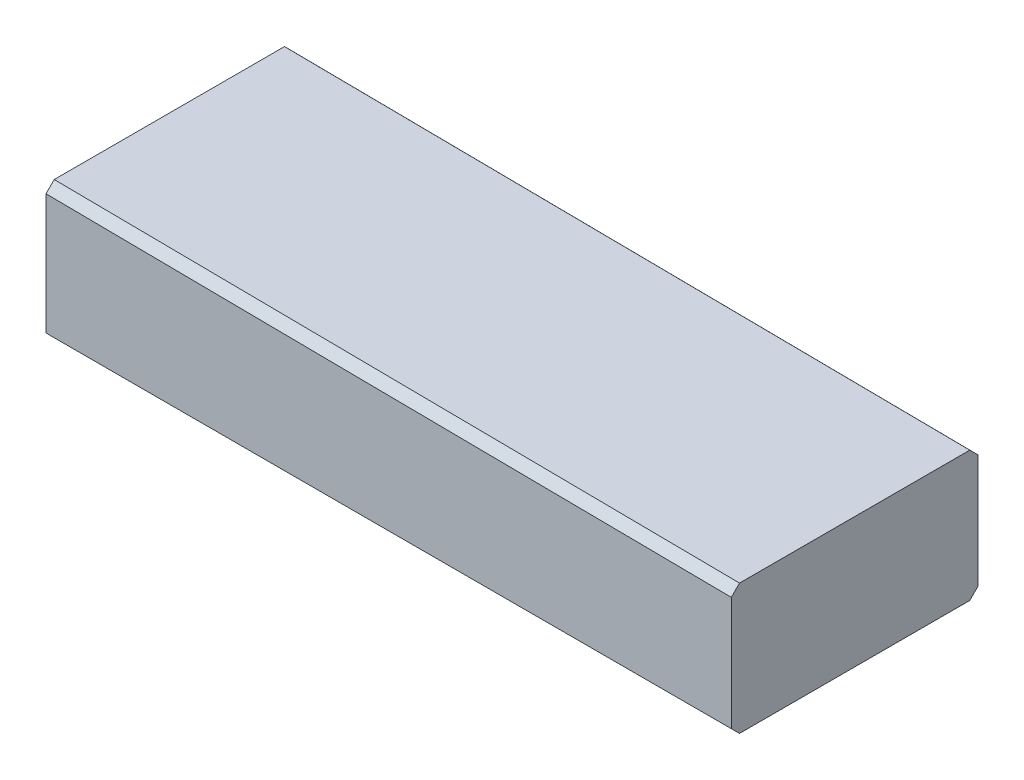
ISO-10303-21;
HEADER;
FILE_DESCRIPTION(('STEP AP214'),'2;1');
FILE_NAME('part.step','',(''),(''),'','','');
FILE_SCHEMA(('AUTOMOTIVE_DESIGN { 1 0 10303 214 1 1 1 1 }'));
ENDSEC;
DATA;
#1=APPLICATION_CONTEXT('core data for automotive mechanical design processes');
#2=APPLICATION_PROTOCOL_DEFINITION('international standard','automotive_design',2000,#1);
#3=PRODUCT_CONTEXT('',#1,'mechanical');
#4=PRODUCT('Part','Part','',(#3));
#5=PRODUCT_RELATED_PRODUCT_CATEGORY('part','',(#4));
#6=PRODUCT_DEFINITION_FORMATION('','',#4);
#7=PRODUCT_DEFINITION_CONTEXT('part definition',#1,'design');
#8=PRODUCT_DEFINITION('design','',#6,#7);
#9=PRODUCT_DEFINITION_SHAPE('','',#8);
#10=(LENGTH_UNIT() NAMED_UNIT(*) SI_UNIT(.MILLI.,.METRE.));
#11=(NAMED_UNIT(*) PLANE_ANGLE_UNIT() SI_UNIT($,.RADIAN.));
#12=(NAMED_UNIT(*) SI_UNIT($,.STERADIAN.) SOLID_ANGLE_UNIT());
#13=UNCERTAINTY_MEASURE_WITH_UNIT(LENGTH_MEASURE(1.E-05),#10,'distance_accuracy_value','');
#14=(GEOMETRIC_REPRESENTATION_CONTEXT(3) GLOBAL_UNCERTAINTY_ASSIGNED_CONTEXT((#13)) GLOBAL_UNIT_ASSIGNED_CONTEXT((#10,
#11,#12)) REPRESENTATION_CONTEXT('',''));
#15=CARTESIAN_POINT('',(0.,0.,0.));
#16=DIRECTION('',(0.,0.,1.));
#17=DIRECTION('',(1.,0.,0.));
#18=AXIS2_PLACEMENT_3D('',#15,#16,#17);
#19=CARTESIAN_POINT('',(100.,0.,36.));
#20=DIRECTION('',(0.,1.,0.));
#21=DIRECTION('',(0.,0.,1.));
#22=AXIS2_PLACEMENT_3D('',#19,#20,#21);
#23=PLANE('',#22);
#24=DIRECTION('',(0.,0.,-1.));
#25=VECTOR('',#24,1.);
#26=CARTESIAN_POINT('',(0.,0.,36.));
#27=LINE('',#26,#25);
#28=CARTESIAN_POINT('',(0.,0.,34.8));
#29=VERTEX_POINT('',#28);
#30=CARTESIAN_POINT('',(0.,0.,1.20000000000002));
#31=VERTEX_POINT('',#30);
#32=EDGE_CURVE('E121',#29,#31,#27,.T.);
#33=ORIENTED_EDGE('',*,*,#32,.T.);
#34=DIRECTION('',(1.,0.,0.));
#35=VECTOR('',#34,1.);
#36=CARTESIAN_POINT('',(100.,0.,1.20000000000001));
#37=LINE('',#36,#35);
#38=CARTESIAN_POINT('',(100.,0.,1.20000000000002));
#39=VERTEX_POINT('',#38);
#40=EDGE_CURVE('E147',#31,#39,#37,.T.);
#41=ORIENTED_EDGE('',*,*,#40,.T.);
#42=DIRECTION('',(0.,0.,-1.));
#43=VECTOR('',#42,1.);
#44=CARTESIAN_POINT('',(100.,0.,36.));
#45=LINE('',#44,#43);
#46=CARTESIAN_POINT('',(100.,0.,34.8));
#47=VERTEX_POINT('',#46);
#48=EDGE_CURVE('E125',#47,#39,#45,.T.);
#49=ORIENTED_EDGE('',*,*,#48,.F.);
#50=DIRECTION('',(-1.,0.,0.));
#51=VECTOR('',#50,1.);
#52=CARTESIAN_POINT('',(100.,0.,34.8));
#53=LINE('',#52,#51);
#54=EDGE_CURVE('E145',#47,#29,#53,.T.);
#55=ORIENTED_EDGE('',*,*,#54,.T.);
#56=EDGE_LOOP('',(#33,#41,#49,#55));
#57=FACE_BOUND('',#56,.T.);
#58=ADVANCED_FACE('F33',(#57),#23,.F.);
#59=CARTESIAN_POINT('',(100.,19.,36.));
#60=DIRECTION('',(-1.,0.,0.));
#61=DIRECTION('',(0.,0.,1.));
#62=AXIS2_PLACEMENT_3D('',#59,#60,#61);
#63=PLANE('',#62);
#64=DIRECTION('',(0.,1.,0.));
#65=VECTOR('',#64,1.);
#66=CARTESIAN_POINT('',(100.,19.,0.));
#67=LINE('',#66,#65);
#68=CARTESIAN_POINT('',(100.,1.20000000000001,0.));
#69=VERTEX_POINT('',#68);
#70=CARTESIAN_POINT('',(100.,17.7999400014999,0.));
#71=VERTEX_POINT('',#70);
#72=EDGE_CURVE('E157',#69,#71,#67,.T.);
#73=ORIENTED_EDGE('',*,*,#72,.T.);
#74=DIRECTION('',(0.,0.707124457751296,0.707089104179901));
#75=VECTOR('',#74,1.);
#76=CARTESIAN_POINT('',(100.,19.5000249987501,1.69999999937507));
#77=LINE('',#76,#75);
#78=CARTESIAN_POINT('',(100.,19.,1.2));
#79=VERTEX_POINT('',#78);
#80=EDGE_CURVE('E143',#71,#79,#77,.T.);
#81=ORIENTED_EDGE('',*,*,#80,.T.);
#82=DIRECTION('',(0.,0.,-1.));
#83=VECTOR('',#82,1.);
#84=CARTESIAN_POINT('',(100.,19.,36.));
#85=LINE('',#84,#83);
#86=CARTESIAN_POINT('',(100.,19.,34.8));
#87=VERTEX_POINT('',#86);
#88=EDGE_CURVE('E120',#87,#79,#85,.T.);
#89=ORIENTED_EDGE('',*,*,#88,.F.);
#90=DIRECTION('',(0.,0.707124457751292,-0.707089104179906));
#91=VECTOR('',#90,1.);
#92=CARTESIAN_POINT('',(100.,18.2990250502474,35.5009399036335));
#93=LINE('',#92,#91);
#94=CARTESIAN_POINT('',(100.,17.7999400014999,36.));
#95=VERTEX_POINT('',#94);
#96=EDGE_CURVE('E124',#87,#95,#93,.F.);
#97=ORIENTED_EDGE('',*,*,#96,.T.);
#98=DIRECTION('',(0.,1.,0.));
#99=VECTOR('',#98,1.);
#100=CARTESIAN_POINT('',(100.,19.,36.));
#101=LINE('',#100,#99);
#102=CARTESIAN_POINT('',(100.,1.20000000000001,36.));
#103=VERTEX_POINT('',#102);
#104=EDGE_CURVE('E152',#103,#95,#101,.T.);
#105=ORIENTED_EDGE('',*,*,#104,.F.);
#106=DIRECTION('',(0.,0.707106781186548,0.707106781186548));
#107=VECTOR('',#106,1.);
#108=CARTESIAN_POINT('',(100.,1.20000000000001,36.));
#109=LINE('',#108,#107);
#110=EDGE_CURVE('E56',#103,#47,#109,.F.);
#111=ORIENTED_EDGE('',*,*,#110,.T.);
#112=ORIENTED_EDGE('',*,*,#48,.T.);
#113=DIRECTION('',(0.,0.707106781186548,-0.707106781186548));
#114=VECTOR('',#113,1.);
#115=CARTESIAN_POINT('',(100.,0.,1.20000000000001));
#116=LINE('',#115,#114);
#117=EDGE_CURVE('E48',#39,#69,#116,.T.);
#118=ORIENTED_EDGE('',*,*,#117,.T.);
#119=EDGE_LOOP('',(#73,#81,#89,#97,#105,#111,#112,#118));
#120=FACE_BOUND('',#119,.T.);
#121=ADVANCED_FACE('F186',(#120),#63,.F.);
#122=CARTESIAN_POINT('',(0.,20.,36.));
#123=DIRECTION('',(-0.00999950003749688,-0.999950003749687,0.));
#124=DIRECTION('',(0.999950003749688,-0.00999950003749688,0.));
#125=AXIS2_PLACEMENT_3D('',#122,#123,#124);
#126=PLANE('',#125);
#127=ORIENTED_EDGE('',*,*,#88,.T.);
#128=DIRECTION('',(-0.999950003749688,0.00999950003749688,0.));
#129=VECTOR('',#128,1.);
#130=CARTESIAN_POINT('',(0.,20.,1.20000000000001));
#131=LINE('',#130,#129);
#132=CARTESIAN_POINT('',(0.,20.,1.2));
#133=VERTEX_POINT('',#132);
#134=EDGE_CURVE('E111',#79,#133,#131,.T.);
#135=ORIENTED_EDGE('',*,*,#134,.T.);
#136=DIRECTION('',(0.,0.,-1.));
#137=VECTOR('',#136,1.);
#138=CARTESIAN_POINT('',(0.,20.,36.));
#139=LINE('',#138,#137);
#140=CARTESIAN_POINT('',(0.,20.,34.8));
#141=VERTEX_POINT('',#140);
#142=EDGE_CURVE('E103',#141,#133,#139,.T.);
#143=ORIENTED_EDGE('',*,*,#142,.F.);
#144=DIRECTION('',(0.999950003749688,-0.00999950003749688,0.));
#145=VECTOR('',#144,1.);
#146=CARTESIAN_POINT('',(0.,20.,34.8));
#147=LINE('',#146,#145);
#148=EDGE_CURVE('E117',#141,#87,#147,.T.);
#149=ORIENTED_EDGE('',*,*,#148,.T.);
#150=EDGE_LOOP('',(#127,#135,#143,#149));
#151=FACE_BOUND('',#150,.T.);
#152=ADVANCED_FACE('F116',(#151),#126,.F.);
#153=CARTESIAN_POINT('',(0.,0.,36.));
#154=DIRECTION('',(1.,0.,0.));
#155=DIRECTION('',(0.,0.,-1.));
#156=AXIS2_PLACEMENT_3D('',#153,#154,#155);
#157=PLANE('',#156);
#158=ORIENTED_EDGE('',*,*,#142,.T.);
#159=DIRECTION('',(0.,-0.707124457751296,-0.707089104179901));
#160=VECTOR('',#159,1.);
#161=CARTESIAN_POINT('',(0.,20.,1.20000000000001));
#162=LINE('',#161,#160);
#163=CARTESIAN_POINT('',(0.,18.7999400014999,0.));
#164=VERTEX_POINT('',#163);
#165=EDGE_CURVE('E134',#133,#164,#162,.T.);
#166=ORIENTED_EDGE('',*,*,#165,.T.);
#167=DIRECTION('',(0.,-1.,0.));
#168=VECTOR('',#167,1.);
#169=CARTESIAN_POINT('',(0.,0.,0.));
#170=LINE('',#169,#168);
#171=CARTESIAN_POINT('',(0.,1.20000000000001,0.));
#172=VERTEX_POINT('',#171);
#173=EDGE_CURVE('E153',#164,#172,#170,.T.);
#174=ORIENTED_EDGE('',*,*,#173,.T.);
#175=DIRECTION('',(0.,-0.707106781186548,0.707106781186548));
#176=VECTOR('',#175,1.);
#177=CARTESIAN_POINT('',(0.,0.,1.20000000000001));
#178=LINE('',#177,#176);
#179=EDGE_CURVE('E132',#172,#31,#178,.T.);
#180=ORIENTED_EDGE('',*,*,#179,.T.);
#181=ORIENTED_EDGE('',*,*,#32,.F.);
#182=DIRECTION('',(0.,-0.707106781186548,-0.707106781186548));
#183=VECTOR('',#182,1.);
#184=CARTESIAN_POINT('',(0.,1.20000000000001,36.));
#185=LINE('',#184,#183);
#186=CARTESIAN_POINT('',(0.,1.20000000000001,36.));
#187=VERTEX_POINT('',#186);
#188=EDGE_CURVE('E110',#29,#187,#185,.F.);
#189=ORIENTED_EDGE('',*,*,#188,.T.);
#190=DIRECTION('',(0.,-1.,0.));
#191=VECTOR('',#190,1.);
#192=CARTESIAN_POINT('',(0.,0.,36.));
#193=LINE('',#192,#191);
#194=CARTESIAN_POINT('',(0.,18.7999400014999,36.));
#195=VERTEX_POINT('',#194);
#196=EDGE_CURVE('E105',#195,#187,#193,.T.);
#197=ORIENTED_EDGE('',*,*,#196,.F.);
#198=DIRECTION('',(0.,-0.707124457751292,0.707089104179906));
#199=VECTOR('',#198,1.);
#200=CARTESIAN_POINT('',(0.,18.7990000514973,36.0009399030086));
#201=LINE('',#200,#199);
#202=EDGE_CURVE('E100',#195,#141,#201,.F.);
#203=ORIENTED_EDGE('',*,*,#202,.T.);
#204=EDGE_LOOP('',(#158,#166,#174,#180,#181,#189,#197,#203));
#205=FACE_BOUND('',#204,.T.);
#206=ADVANCED_FACE('F102',(#205),#157,.F.);
#207=CARTESIAN_POINT('',(0.,0.,36.));
#208=DIRECTION('',(0.,0.,-1.));
#209=DIRECTION('',(-1.,0.,0.));
#210=AXIS2_PLACEMENT_3D('',#207,#208,#209);
#211=PLANE('',#210);
#212=ORIENTED_EDGE('',*,*,#196,.T.);
#213=DIRECTION('',(1.,0.,0.));
#214=VECTOR('',#213,1.);
#215=CARTESIAN_POINT('',(0.,1.20000000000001,36.));
#216=LINE('',#215,#214);
#217=EDGE_CURVE('E11',#187,#103,#216,.T.);
#218=ORIENTED_EDGE('',*,*,#217,.T.);
#219=ORIENTED_EDGE('',*,*,#104,.T.);
#220=DIRECTION('',(-0.999950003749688,0.00999950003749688,0.));
#221=VECTOR('',#220,1.);
#222=CARTESIAN_POINT('',(0.187980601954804,18.7980601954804,36.));
#223=LINE('',#222,#221);
#224=EDGE_CURVE('E41',#95,#195,#223,.T.);
#225=ORIENTED_EDGE('',*,*,#224,.T.);
#226=EDGE_LOOP('',(#212,#218,#219,#225));
#227=FACE_BOUND('',#226,.T.);
#228=ADVANCED_FACE('F150',(#227),#211,.F.);
#229=CARTESIAN_POINT('',(0.,0.,0.));
#230=DIRECTION('',(0.,0.,-1.));
#231=DIRECTION('',(-1.,0.,0.));
#232=AXIS2_PLACEMENT_3D('',#229,#230,#231);
#233=PLANE('',#232);
#234=ORIENTED_EDGE('',*,*,#173,.F.);
#235=DIRECTION('',(0.999950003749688,-0.00999950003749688,0.));
#236=VECTOR('',#235,1.);
#237=CARTESIAN_POINT('',(99.988000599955,17.8000599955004,0.));
#238=LINE('',#237,#236);
#239=EDGE_CURVE('E138',#164,#71,#238,.T.);
#240=ORIENTED_EDGE('',*,*,#239,.T.);
#241=ORIENTED_EDGE('',*,*,#72,.F.);
#242=DIRECTION('',(-1.,0.,0.));
#243=VECTOR('',#242,1.);
#244=CARTESIAN_POINT('',(0.,1.20000000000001,0.));
#245=LINE('',#244,#243);
#246=EDGE_CURVE('E136',#69,#172,#245,.T.);
#247=ORIENTED_EDGE('',*,*,#246,.T.);
#248=EDGE_LOOP('',(#234,#240,#241,#247));
#249=FACE_BOUND('',#248,.T.);
#250=ADVANCED_FACE('F170',(#249),#233,.T.);
#251=CARTESIAN_POINT('',(0.,20.,1.20000000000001));
#252=DIRECTION('',(0.00707071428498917,0.707071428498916,-0.707106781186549));
#253=DIRECTION('',(0.,0.707124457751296,0.707089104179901));
#254=AXIS2_PLACEMENT_3D('',#251,#252,#253);
#255=PLANE('',#254);
#256=ORIENTED_EDGE('',*,*,#80,.F.);
#257=ORIENTED_EDGE('',*,*,#239,.F.);
#258=ORIENTED_EDGE('',*,*,#165,.F.);
#259=ORIENTED_EDGE('',*,*,#134,.F.);
#260=EDGE_LOOP('',(#256,#257,#258,#259));
#261=FACE_BOUND('',#260,.T.);
#262=ADVANCED_FACE('F165',(#261),#255,.T.);
#263=CARTESIAN_POINT('',(100.,0.,1.20000000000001));
#264=DIRECTION('',(0.,-0.707106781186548,-0.707106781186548));
#265=DIRECTION('',(0.,0.707106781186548,-0.707106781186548));
#266=AXIS2_PLACEMENT_3D('',#263,#264,#265);
#267=PLANE('',#266);
#268=ORIENTED_EDGE('',*,*,#179,.F.);
#269=ORIENTED_EDGE('',*,*,#246,.F.);
#270=ORIENTED_EDGE('',*,*,#117,.F.);
#271=ORIENTED_EDGE('',*,*,#40,.F.);
#272=EDGE_LOOP('',(#268,#269,#270,#271));
#273=FACE_BOUND('',#272,.T.);
#274=ADVANCED_FACE('F172',(#273),#267,.T.);
#275=CARTESIAN_POINT('',(0.,1.20000000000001,36.));
#276=DIRECTION('',(0.,0.707106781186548,-0.707106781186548));
#277=DIRECTION('',(0.,0.707106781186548,0.707106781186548));
#278=AXIS2_PLACEMENT_3D('',#275,#276,#277);
#279=PLANE('',#278);
#280=ORIENTED_EDGE('',*,*,#188,.F.);
#281=ORIENTED_EDGE('',*,*,#54,.F.);
#282=ORIENTED_EDGE('',*,*,#110,.F.);
#283=ORIENTED_EDGE('',*,*,#217,.F.);
#284=EDGE_LOOP('',(#280,#281,#282,#283));
#285=FACE_BOUND('',#284,.T.);
#286=ADVANCED_FACE('F178',(#285),#279,.F.);
#287=CARTESIAN_POINT('',(0.187980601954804,18.7980601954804,36.));
#288=DIRECTION('',(-0.00707071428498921,-0.70707142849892,-0.707106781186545));
#289=DIRECTION('',(0.,0.707124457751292,-0.707089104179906));
#290=AXIS2_PLACEMENT_3D('',#287,#288,#289);
#291=PLANE('',#290);
#292=ORIENTED_EDGE('',*,*,#96,.F.);
#293=ORIENTED_EDGE('',*,*,#148,.F.);
#294=ORIENTED_EDGE('',*,*,#202,.F.);
#295=ORIENTED_EDGE('',*,*,#224,.F.);
#296=EDGE_LOOP('',(#292,#293,#294,#295));
#297=FACE_BOUND('',#296,.T.);
#298=ADVANCED_FACE('F35',(#297),#291,.F.);
#299=CLOSED_SHELL('',(#58,#121,#152,#206,#228,#250,#262,#274,#286,#298));
#300=MANIFOLD_SOLID_BREP('B2',#299);
#301=ADVANCED_BREP_SHAPE_REPRESENTATION('',(#18,#300),#14);
#302=SHAPE_DEFINITION_REPRESENTATION(#9,#301);
ENDSEC;
END-ISO-10303-21;
